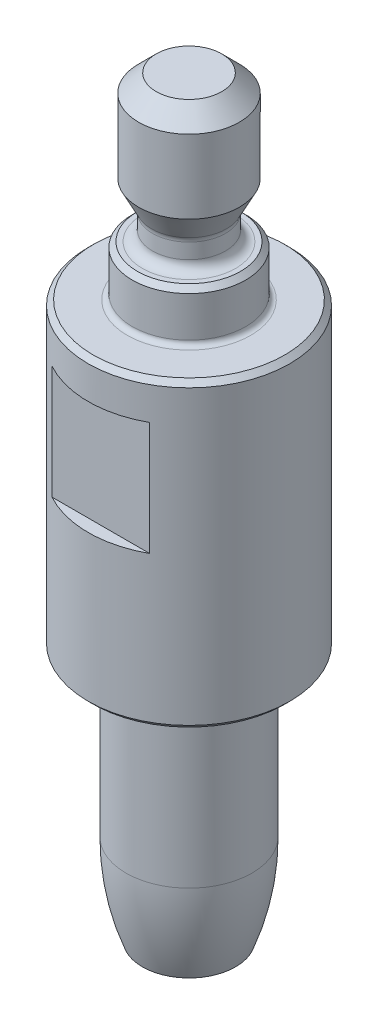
ISO-10303-21;
HEADER;
FILE_DESCRIPTION(('STEP AP214'),'2;1');
FILE_NAME('part.step','',(''),(''),'','','');
FILE_SCHEMA(('AUTOMOTIVE_DESIGN { 1 0 10303 214 1 1 1 1 }'));
ENDSEC;
DATA;
#1=APPLICATION_CONTEXT('core data for automotive mechanical design processes');
#2=APPLICATION_PROTOCOL_DEFINITION('international standard','automotive_design',2000,#1);
#3=PRODUCT_CONTEXT('',#1,'mechanical');
#4=PRODUCT('Part','Part','',(#3));
#5=PRODUCT_RELATED_PRODUCT_CATEGORY('part','',(#4));
#6=PRODUCT_DEFINITION_FORMATION('','',#4);
#7=PRODUCT_DEFINITION_CONTEXT('part definition',#1,'design');
#8=PRODUCT_DEFINITION('design','',#6,#7);
#9=PRODUCT_DEFINITION_SHAPE('','',#8);
#10=(LENGTH_UNIT() NAMED_UNIT(*) SI_UNIT(.MILLI.,.METRE.));
#11=(NAMED_UNIT(*) PLANE_ANGLE_UNIT() SI_UNIT($,.RADIAN.));
#12=(NAMED_UNIT(*) SI_UNIT($,.STERADIAN.) SOLID_ANGLE_UNIT());
#13=UNCERTAINTY_MEASURE_WITH_UNIT(LENGTH_MEASURE(1.E-05),#10,'distance_accuracy_value','');
#14=(GEOMETRIC_REPRESENTATION_CONTEXT(3) GLOBAL_UNCERTAINTY_ASSIGNED_CONTEXT((#13)) GLOBAL_UNIT_ASSIGNED_CONTEXT((#10,
#11,#12)) REPRESENTATION_CONTEXT('',''));
#15=CARTESIAN_POINT('',(0.,0.,0.));
#16=DIRECTION('',(0.,0.,1.));
#17=DIRECTION('',(1.,0.,0.));
#18=AXIS2_PLACEMENT_3D('',#15,#16,#17);
#19=CARTESIAN_POINT('',(0.,0.,0.));
#20=DIRECTION('',(0.,1.,0.));
#21=DIRECTION('',(-1.,0.,0.));
#22=AXIS2_PLACEMENT_3D('',#19,#20,#21);
#23=CYLINDRICAL_SURFACE('',#22,2.5);
#24=CARTESIAN_POINT('',(0.,-12.2,0.));
#25=DIRECTION('',(0.,-1.,0.));
#26=DIRECTION('',(0.,0.,-1.));
#27=AXIS2_PLACEMENT_3D('',#24,#25,#26);
#28=CIRCLE('',#27,2.5);
#29=CARTESIAN_POINT('',(0.,-12.2,-2.5));
#30=VERTEX_POINT('',#29);
#31=EDGE_CURVE('E64',#30,#30,#28,.T.);
#32=ORIENTED_EDGE('',*,*,#31,.T.);
#33=EDGE_LOOP('',(#32));
#34=FACE_BOUND('',#33,.T.);
#35=CARTESIAN_POINT('',(0.,-18.4535228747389,0.));
#36=DIRECTION('',(0.,1.,0.));
#37=DIRECTION('',(0.,0.,1.));
#38=AXIS2_PLACEMENT_3D('',#35,#36,#37);
#39=CIRCLE('',#38,2.5);
#40=CARTESIAN_POINT('',(0.,-18.4535228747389,2.5));
#41=VERTEX_POINT('',#40);
#42=EDGE_CURVE('E295',#41,#41,#39,.T.);
#43=ORIENTED_EDGE('',*,*,#42,.T.);
#44=EDGE_LOOP('',(#43));
#45=FACE_BOUND('',#44,.T.);
#46=ADVANCED_FACE('F15',(#34,#45),#23,.T.);
#47=CARTESIAN_POINT('',(0.,0.,0.));
#48=DIRECTION('',(0.,1.,0.));
#49=DIRECTION('',(0.,0.,1.));
#50=AXIS2_PLACEMENT_3D('',#47,#48,#49);
#51=PLANE('',#50);
#52=CARTESIAN_POINT('',(0.,0.,0.));
#53=DIRECTION('',(0.,1.,0.));
#54=DIRECTION('',(0.,0.,1.));
#55=AXIS2_PLACEMENT_3D('',#52,#53,#54);
#56=CIRCLE('',#55,2.45);
#57=CARTESIAN_POINT('',(0.,0.,2.45));
#58=VERTEX_POINT('',#57);
#59=EDGE_CURVE('E122',#58,#58,#56,.F.);
#60=ORIENTED_EDGE('',*,*,#59,.T.);
#61=EDGE_LOOP('',(#60));
#62=FACE_BOUND('',#61,.T.);
#63=CARTESIAN_POINT('',(0.,0.,0.));
#64=DIRECTION('',(0.,1.,0.));
#65=DIRECTION('',(0.,0.,1.));
#66=AXIS2_PLACEMENT_3D('',#63,#64,#65);
#67=CIRCLE('',#66,3.8);
#68=CARTESIAN_POINT('',(0.,0.,3.8));
#69=VERTEX_POINT('',#68);
#70=EDGE_CURVE('E107',#69,#69,#67,.T.);
#71=ORIENTED_EDGE('',*,*,#70,.T.);
#72=EDGE_LOOP('',(#71));
#73=FACE_BOUND('',#72,.T.);
#74=ADVANCED_FACE('F147',(#62,#73),#51,.T.);
#75=CARTESIAN_POINT('',(0.,0.,0.));
#76=DIRECTION('',(0.,-1.,0.));
#77=DIRECTION('',(0.,0.,-1.));
#78=AXIS2_PLACEMENT_3D('',#75,#76,#77);
#79=CYLINDRICAL_SURFACE('',#78,4.);
#80=DIRECTION('',(0.,-1.,0.));
#81=VECTOR('',#80,1.);
#82=CARTESIAN_POINT('',(-1.93649167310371,0.,3.5));
#83=LINE('',#82,#81);
#84=CARTESIAN_POINT('',(-1.93649167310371,-1.5,3.5));
#85=VERTEX_POINT('',#84);
#86=CARTESIAN_POINT('',(-1.93649167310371,-6.,3.5));
#87=VERTEX_POINT('',#86);
#88=EDGE_CURVE('E137',#85,#87,#83,.T.);
#89=ORIENTED_EDGE('',*,*,#88,.F.);
#90=CARTESIAN_POINT('',(0.,-1.5,0.));
#91=DIRECTION('',(0.,1.,0.));
#92=DIRECTION('',(0.,0.,1.));
#93=AXIS2_PLACEMENT_3D('',#90,#91,#92);
#94=CIRCLE('',#93,4.);
#95=CARTESIAN_POINT('',(1.93649167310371,-1.5,3.5));
#96=VERTEX_POINT('',#95);
#97=EDGE_CURVE('E9',#96,#85,#94,.F.);
#98=ORIENTED_EDGE('',*,*,#97,.F.);
#99=DIRECTION('',(0.,-1.,0.));
#100=VECTOR('',#99,1.);
#101=CARTESIAN_POINT('',(1.93649167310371,0.,3.5));
#102=LINE('',#101,#100);
#103=CARTESIAN_POINT('',(1.93649167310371,-6.,3.5));
#104=VERTEX_POINT('',#103);
#105=EDGE_CURVE('E23',#104,#96,#102,.F.);
#106=ORIENTED_EDGE('',*,*,#105,.F.);
#107=CARTESIAN_POINT('',(0.,-6.,0.));
#108=DIRECTION('',(0.,-1.,0.));
#109=DIRECTION('',(0.,0.,-1.));
#110=AXIS2_PLACEMENT_3D('',#107,#108,#109);
#111=CIRCLE('',#110,4.);
#112=EDGE_CURVE('E135',#87,#104,#111,.F.);
#113=ORIENTED_EDGE('',*,*,#112,.F.);
#114=EDGE_LOOP('',(#89,#98,#106,#113));
#115=FACE_BOUND('',#114,.T.);
#116=DIRECTION('',(0.,-1.,0.));
#117=VECTOR('',#116,1.);
#118=CARTESIAN_POINT('',(-1.93649167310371,0.,-3.5));
#119=LINE('',#118,#117);
#120=CARTESIAN_POINT('',(-1.93649167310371,-6.,-3.5));
#121=VERTEX_POINT('',#120);
#122=CARTESIAN_POINT('',(-1.93649167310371,-1.5,-3.5));
#123=VERTEX_POINT('',#122);
#124=EDGE_CURVE('E59',#121,#123,#119,.F.);
#125=ORIENTED_EDGE('',*,*,#124,.F.);
#126=CARTESIAN_POINT('',(0.,-6.,0.));
#127=DIRECTION('',(0.,-1.,0.));
#128=DIRECTION('',(0.,0.,-1.));
#129=AXIS2_PLACEMENT_3D('',#126,#127,#128);
#130=CIRCLE('',#129,4.);
#131=CARTESIAN_POINT('',(1.93649167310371,-6.,-3.5));
#132=VERTEX_POINT('',#131);
#133=EDGE_CURVE('E72',#132,#121,#130,.F.);
#134=ORIENTED_EDGE('',*,*,#133,.F.);
#135=DIRECTION('',(0.,-1.,0.));
#136=VECTOR('',#135,1.);
#137=CARTESIAN_POINT('',(1.93649167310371,0.,-3.5));
#138=LINE('',#137,#136);
#139=CARTESIAN_POINT('',(1.93649167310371,-1.5,-3.5));
#140=VERTEX_POINT('',#139);
#141=EDGE_CURVE('E60',#140,#132,#138,.T.);
#142=ORIENTED_EDGE('',*,*,#141,.F.);
#143=CARTESIAN_POINT('',(0.,-1.5,0.));
#144=DIRECTION('',(0.,1.,0.));
#145=DIRECTION('',(0.,0.,1.));
#146=AXIS2_PLACEMENT_3D('',#143,#144,#145);
#147=CIRCLE('',#146,4.);
#148=EDGE_CURVE('E54',#123,#140,#147,.F.);
#149=ORIENTED_EDGE('',*,*,#148,.F.);
#150=EDGE_LOOP('',(#125,#134,#142,#149));
#151=FACE_BOUND('',#150,.T.);
#152=CARTESIAN_POINT('',(0.,-11.8,0.));
#153=DIRECTION('',(0.,-1.,0.));
#154=DIRECTION('',(0.,0.,-1.));
#155=AXIS2_PLACEMENT_3D('',#152,#153,#154);
#156=CIRCLE('',#155,4.);
#157=CARTESIAN_POINT('',(0.,-11.8,-4.));
#158=VERTEX_POINT('',#157);
#159=EDGE_CURVE('E119',#158,#158,#156,.F.);
#160=ORIENTED_EDGE('',*,*,#159,.T.);
#161=EDGE_LOOP('',(#160));
#162=FACE_BOUND('',#161,.T.);
#163=CARTESIAN_POINT('',(0.,-0.2,0.));
#164=DIRECTION('',(0.,1.,0.));
#165=DIRECTION('',(0.,0.,1.));
#166=AXIS2_PLACEMENT_3D('',#163,#164,#165);
#167=CIRCLE('',#166,4.);
#168=CARTESIAN_POINT('',(0.,-0.2,4.));
#169=VERTEX_POINT('',#168);
#170=EDGE_CURVE('E104',#169,#169,#167,.F.);
#171=ORIENTED_EDGE('',*,*,#170,.T.);
#172=EDGE_LOOP('',(#171));
#173=FACE_BOUND('',#172,.T.);
#174=ADVANCED_FACE('F56',(#115,#151,#162,#173),#79,.T.);
#175=CARTESIAN_POINT('',(4.,-12.,0.));
#176=DIRECTION('',(0.,-1.,0.));
#177=DIRECTION('',(0.,0.,-1.));
#178=AXIS2_PLACEMENT_3D('',#175,#176,#177);
#179=PLANE('',#178);
#180=CARTESIAN_POINT('',(0.,-12.,0.));
#181=DIRECTION('',(0.,-1.,0.));
#182=DIRECTION('',(0.,0.,-1.));
#183=AXIS2_PLACEMENT_3D('',#180,#181,#182);
#184=CIRCLE('',#183,2.7);
#185=CARTESIAN_POINT('',(0.,-12.,-2.7));
#186=VERTEX_POINT('',#185);
#187=EDGE_CURVE('E128',#186,#186,#184,.F.);
#188=ORIENTED_EDGE('',*,*,#187,.T.);
#189=EDGE_LOOP('',(#188));
#190=FACE_BOUND('',#189,.T.);
#191=CARTESIAN_POINT('',(0.,-12.,0.));
#192=DIRECTION('',(0.,-1.,0.));
#193=DIRECTION('',(0.,0.,-1.));
#194=AXIS2_PLACEMENT_3D('',#191,#192,#193);
#195=CIRCLE('',#194,3.8);
#196=CARTESIAN_POINT('',(0.,-12.,-3.8));
#197=VERTEX_POINT('',#196);
#198=EDGE_CURVE('E116',#197,#197,#195,.T.);
#199=ORIENTED_EDGE('',*,*,#198,.T.);
#200=EDGE_LOOP('',(#199));
#201=FACE_BOUND('',#200,.T.);
#202=ADVANCED_FACE('F146',(#190,#201),#179,.T.);
#203=CARTESIAN_POINT('',(0.,2.,0.));
#204=DIRECTION('',(0.,1.,0.));
#205=DIRECTION('',(0.,0.,1.));
#206=AXIS2_PLACEMENT_3D('',#203,#204,#205);
#207=PLANE('',#206);
#208=CARTESIAN_POINT('',(0.,2.,0.));
#209=DIRECTION('',(0.,1.,0.));
#210=DIRECTION('',(0.,0.,1.));
#211=AXIS2_PLACEMENT_3D('',#208,#209,#210);
#212=CIRCLE('',#211,2.05);
#213=CARTESIAN_POINT('',(0.,2.,2.05));
#214=VERTEX_POINT('',#213);
#215=EDGE_CURVE('E113',#214,#214,#212,.T.);
#216=ORIENTED_EDGE('',*,*,#215,.T.);
#217=EDGE_LOOP('',(#216));
#218=FACE_BOUND('',#217,.T.);
#219=CARTESIAN_POINT('',(0.,2.,0.));
#220=DIRECTION('',(0.,1.,0.));
#221=DIRECTION('',(0.,0.,1.));
#222=AXIS2_PLACEMENT_3D('',#219,#220,#221);
#223=CIRCLE('',#222,1.85);
#224=CARTESIAN_POINT('',(0.,2.,1.85));
#225=VERTEX_POINT('',#224);
#226=EDGE_CURVE('E101',#225,#225,#223,.F.);
#227=ORIENTED_EDGE('',*,*,#226,.T.);
#228=EDGE_LOOP('',(#227));
#229=FACE_BOUND('',#228,.T.);
#230=ADVANCED_FACE('F155',(#218,#229),#207,.T.);
#231=CARTESIAN_POINT('',(0.,0.,0.));
#232=DIRECTION('',(0.,-1.,0.));
#233=DIRECTION('',(0.,0.,-1.));
#234=AXIS2_PLACEMENT_3D('',#231,#232,#233);
#235=CYLINDRICAL_SURFACE('',#234,2.25);
#236=CARTESIAN_POINT('',(0.,0.2,0.));
#237=DIRECTION('',(0.,1.,0.));
#238=DIRECTION('',(0.,0.,1.));
#239=AXIS2_PLACEMENT_3D('',#236,#237,#238);
#240=CIRCLE('',#239,2.25);
#241=CARTESIAN_POINT('',(0.,0.2,2.25));
#242=VERTEX_POINT('',#241);
#243=EDGE_CURVE('E125',#242,#242,#240,.T.);
#244=ORIENTED_EDGE('',*,*,#243,.T.);
#245=EDGE_LOOP('',(#244));
#246=FACE_BOUND('',#245,.T.);
#247=CARTESIAN_POINT('',(0.,1.8,0.));
#248=DIRECTION('',(0.,1.,0.));
#249=DIRECTION('',(0.,0.,1.));
#250=AXIS2_PLACEMENT_3D('',#247,#248,#249);
#251=CIRCLE('',#250,2.25);
#252=CARTESIAN_POINT('',(0.,1.8,2.25));
#253=VERTEX_POINT('',#252);
#254=EDGE_CURVE('E110',#253,#253,#251,.F.);
#255=ORIENTED_EDGE('',*,*,#254,.T.);
#256=EDGE_LOOP('',(#255));
#257=FACE_BOUND('',#256,.T.);
#258=ADVANCED_FACE('F179',(#246,#257),#235,.T.);
#259=CARTESIAN_POINT('',(0.,4.17943577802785,0.));
#260=DIRECTION('',(0.,1.,0.));
#261=DIRECTION('',(0.,0.,1.));
#262=AXIS2_PLACEMENT_3D('',#259,#260,#261);
#263=CONICAL_SURFACE('',#262,2.,0.471238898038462);
#264=CARTESIAN_POINT('',(0.,3.18556469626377,0.));
#265=DIRECTION('',(0.,1.,0.));
#266=DIRECTION('',(0.,0.,1.));
#267=AXIS2_PLACEMENT_3D('',#264,#265,#266);
#268=CIRCLE('',#267,1.49359739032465);
#269=CARTESIAN_POINT('',(0.,3.18556469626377,1.49359739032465));
#270=VERTEX_POINT('',#269);
#271=EDGE_CURVE('E98',#270,#270,#268,.T.);
#272=ORIENTED_EDGE('',*,*,#271,.T.);
#273=EDGE_LOOP('',(#272));
#274=FACE_BOUND('',#273,.T.);
#275=CARTESIAN_POINT('',(0.,4.17943577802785,0.));
#276=DIRECTION('',(0.,-1.,0.));
#277=DIRECTION('',(0.,0.,-1.));
#278=AXIS2_PLACEMENT_3D('',#275,#276,#277);
#279=CIRCLE('',#278,2.);
#280=CARTESIAN_POINT('',(0.,4.17943577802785,-2.));
#281=VERTEX_POINT('',#280);
#282=EDGE_CURVE('E83',#281,#281,#279,.T.);
#283=ORIENTED_EDGE('',*,*,#282,.T.);
#284=EDGE_LOOP('',(#283));
#285=FACE_BOUND('',#284,.T.);
#286=ADVANCED_FACE('F175',(#274,#285),#263,.T.);
#287=CARTESIAN_POINT('',(0.,0.,0.));
#288=DIRECTION('',(0.,-1.,0.));
#289=DIRECTION('',(0.,0.,-1.));
#290=AXIS2_PLACEMENT_3D('',#287,#288,#289);
#291=CYLINDRICAL_SURFACE('',#290,1.45);
#292=CARTESIAN_POINT('',(0.,3.00396849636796,0.));
#293=DIRECTION('',(0.,-1.,0.));
#294=DIRECTION('',(0.,0.,-1.));
#295=AXIS2_PLACEMENT_3D('',#292,#293,#294);
#296=CIRCLE('',#295,1.45);
#297=CARTESIAN_POINT('',(0.,3.00396849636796,-1.45));
#298=VERTEX_POINT('',#297);
#299=EDGE_CURVE('E95',#298,#298,#296,.T.);
#300=ORIENTED_EDGE('',*,*,#299,.T.);
#301=EDGE_LOOP('',(#300));
#302=FACE_BOUND('',#301,.T.);
#303=CARTESIAN_POINT('',(0.,2.4,0.));
#304=DIRECTION('',(0.,1.,0.));
#305=DIRECTION('',(0.,0.,1.));
#306=AXIS2_PLACEMENT_3D('',#303,#304,#305);
#307=CIRCLE('',#306,1.45);
#308=CARTESIAN_POINT('',(0.,2.4,1.45));
#309=VERTEX_POINT('',#308);
#310=EDGE_CURVE('E92',#309,#309,#307,.T.);
#311=ORIENTED_EDGE('',*,*,#310,.T.);
#312=EDGE_LOOP('',(#311));
#313=FACE_BOUND('',#312,.T.);
#314=ADVANCED_FACE('F171',(#302,#313),#291,.T.);
#315=CARTESIAN_POINT('',(0.,7.8,0.));
#316=DIRECTION('',(0.,1.,0.));
#317=DIRECTION('',(0.,0.,1.));
#318=AXIS2_PLACEMENT_3D('',#315,#316,#317);
#319=PLANE('',#318);
#320=CARTESIAN_POINT('',(0.,7.8,0.));
#321=DIRECTION('',(0.,1.,0.));
#322=DIRECTION('',(0.,0.,1.));
#323=AXIS2_PLACEMENT_3D('',#320,#321,#322);
#324=CIRCLE('',#323,1.3);
#325=CARTESIAN_POINT('',(0.,7.8,1.3));
#326=VERTEX_POINT('',#325);
#327=EDGE_CURVE('E89',#326,#326,#324,.T.);
#328=ORIENTED_EDGE('',*,*,#327,.T.);
#329=EDGE_LOOP('',(#328));
#330=FACE_BOUND('',#329,.T.);
#331=ADVANCED_FACE('F174',(#330),#319,.T.);
#332=CARTESIAN_POINT('',(0.,7.1,0.));
#333=DIRECTION('',(0.,-1.,0.));
#334=DIRECTION('',(0.,0.,-1.));
#335=AXIS2_PLACEMENT_3D('',#332,#333,#334);
#336=CONICAL_SURFACE('',#335,2.,0.78539816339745);
#337=ORIENTED_EDGE('',*,*,#327,.F.);
#338=EDGE_LOOP('',(#337));
#339=FACE_BOUND('',#338,.T.);
#340=CARTESIAN_POINT('',(0.,7.1,0.));
#341=DIRECTION('',(0.,1.,0.));
#342=DIRECTION('',(0.,0.,1.));
#343=AXIS2_PLACEMENT_3D('',#340,#341,#342);
#344=CIRCLE('',#343,2.);
#345=CARTESIAN_POINT('',(0.,7.1,2.));
#346=VERTEX_POINT('',#345);
#347=EDGE_CURVE('E86',#346,#346,#344,.F.);
#348=ORIENTED_EDGE('',*,*,#347,.F.);
#349=EDGE_LOOP('',(#348));
#350=FACE_BOUND('',#349,.T.);
#351=ADVANCED_FACE('F185',(#339,#350),#336,.T.);
#352=CARTESIAN_POINT('',(0.,2.,0.));
#353=DIRECTION('',(0.,-1.,0.));
#354=DIRECTION('',(0.,0.,-1.));
#355=AXIS2_PLACEMENT_3D('',#352,#353,#354);
#356=CYLINDRICAL_SURFACE('',#355,2.);
#357=ORIENTED_EDGE('',*,*,#282,.F.);
#358=EDGE_LOOP('',(#357));
#359=FACE_BOUND('',#358,.T.);
#360=ORIENTED_EDGE('',*,*,#347,.T.);
#361=EDGE_LOOP('',(#360));
#362=FACE_BOUND('',#361,.T.);
#363=ADVANCED_FACE('F181',(#359,#362),#356,.T.);
#364=CARTESIAN_POINT('',(0.,3.00396849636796,0.));
#365=DIRECTION('',(0.,-1.,0.));
#366=DIRECTION('',(0.,0.,-1.));
#367=AXIS2_PLACEMENT_3D('',#364,#365,#366);
#368=TOROIDAL_SURFACE('',#367,1.85,0.4);
#369=ORIENTED_EDGE('',*,*,#271,.F.);
#370=EDGE_LOOP('',(#369));
#371=FACE_BOUND('',#370,.T.);
#372=ORIENTED_EDGE('',*,*,#299,.F.);
#373=EDGE_LOOP('',(#372));
#374=FACE_BOUND('',#373,.T.);
#375=ADVANCED_FACE('F184',(#371,#374),#368,.F.);
#376=CARTESIAN_POINT('',(0.,2.4,0.));
#377=DIRECTION('',(0.,1.,0.));
#378=DIRECTION('',(0.,0.,1.));
#379=AXIS2_PLACEMENT_3D('',#376,#377,#378);
#380=TOROIDAL_SURFACE('',#379,1.85,0.4);
#381=ORIENTED_EDGE('',*,*,#310,.F.);
#382=EDGE_LOOP('',(#381));
#383=FACE_BOUND('',#382,.T.);
#384=ORIENTED_EDGE('',*,*,#226,.F.);
#385=EDGE_LOOP('',(#384));
#386=FACE_BOUND('',#385,.T.);
#387=ADVANCED_FACE('F202',(#383,#386),#380,.F.);
#388=CARTESIAN_POINT('',(0.,-0.2,0.));
#389=DIRECTION('',(0.,-1.,0.));
#390=DIRECTION('',(0.,0.,-1.));
#391=AXIS2_PLACEMENT_3D('',#388,#389,#390);
#392=CONICAL_SURFACE('',#391,4.,0.785398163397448);
#393=ORIENTED_EDGE('',*,*,#70,.F.);
#394=EDGE_LOOP('',(#393));
#395=FACE_BOUND('',#394,.T.);
#396=ORIENTED_EDGE('',*,*,#170,.F.);
#397=EDGE_LOOP('',(#396));
#398=FACE_BOUND('',#397,.T.);
#399=ADVANCED_FACE('F204',(#395,#398),#392,.T.);
#400=CARTESIAN_POINT('',(0.,1.8,0.));
#401=DIRECTION('',(0.,-1.,0.));
#402=DIRECTION('',(0.,0.,-1.));
#403=AXIS2_PLACEMENT_3D('',#400,#401,#402);
#404=CONICAL_SURFACE('',#403,2.25,0.785398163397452);
#405=ORIENTED_EDGE('',*,*,#215,.F.);
#406=EDGE_LOOP('',(#405));
#407=FACE_BOUND('',#406,.T.);
#408=ORIENTED_EDGE('',*,*,#254,.F.);
#409=EDGE_LOOP('',(#408));
#410=FACE_BOUND('',#409,.T.);
#411=ADVANCED_FACE('F212',(#407,#410),#404,.T.);
#412=CARTESIAN_POINT('',(0.,-12.,0.));
#413=DIRECTION('',(0.,1.,0.));
#414=DIRECTION('',(0.,0.,1.));
#415=AXIS2_PLACEMENT_3D('',#412,#413,#414);
#416=CONICAL_SURFACE('',#415,3.8,0.78539816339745);
#417=ORIENTED_EDGE('',*,*,#159,.F.);
#418=EDGE_LOOP('',(#417));
#419=FACE_BOUND('',#418,.T.);
#420=ORIENTED_EDGE('',*,*,#198,.F.);
#421=EDGE_LOOP('',(#420));
#422=FACE_BOUND('',#421,.T.);
#423=ADVANCED_FACE('F230',(#419,#422),#416,.T.);
#424=CARTESIAN_POINT('',(0.,0.2,0.));
#425=DIRECTION('',(0.,1.,0.));
#426=DIRECTION('',(0.,0.,1.));
#427=AXIS2_PLACEMENT_3D('',#424,#425,#426);
#428=TOROIDAL_SURFACE('',#427,2.45,0.2);
#429=ORIENTED_EDGE('',*,*,#243,.F.);
#430=EDGE_LOOP('',(#429));
#431=FACE_BOUND('',#430,.T.);
#432=ORIENTED_EDGE('',*,*,#59,.F.);
#433=EDGE_LOOP('',(#432));
#434=FACE_BOUND('',#433,.T.);
#435=ADVANCED_FACE('F235',(#431,#434),#428,.F.);
#436=CARTESIAN_POINT('',(0.,-12.2,0.));
#437=DIRECTION('',(0.,-1.,0.));
#438=DIRECTION('',(0.,0.,-1.));
#439=AXIS2_PLACEMENT_3D('',#436,#437,#438);
#440=TOROIDAL_SURFACE('',#439,2.7,0.2);
#441=ORIENTED_EDGE('',*,*,#31,.F.);
#442=EDGE_LOOP('',(#441));
#443=FACE_BOUND('',#442,.T.);
#444=ORIENTED_EDGE('',*,*,#187,.F.);
#445=EDGE_LOOP('',(#444));
#446=FACE_BOUND('',#445,.T.);
#447=ADVANCED_FACE('F17',(#443,#446),#440,.F.);
#448=CARTESIAN_POINT('',(-4.,-6.,-4.));
#449=DIRECTION('',(0.,-1.,0.));
#450=DIRECTION('',(0.,0.,-1.));
#451=AXIS2_PLACEMENT_3D('',#448,#449,#450);
#452=PLANE('',#451);
#453=ORIENTED_EDGE('',*,*,#133,.T.);
#454=DIRECTION('',(1.,0.,0.));
#455=VECTOR('',#454,1.);
#456=CARTESIAN_POINT('',(-4.,-6.,-3.5));
#457=LINE('',#456,#455);
#458=EDGE_CURVE('E71',#121,#132,#457,.T.);
#459=ORIENTED_EDGE('',*,*,#458,.T.);
#460=EDGE_LOOP('',(#453,#459));
#461=FACE_BOUND('',#460,.T.);
#462=ADVANCED_FACE('F243',(#461),#452,.F.);
#463=CARTESIAN_POINT('',(-4.,-1.5,-3.5));
#464=DIRECTION('',(0.,0.,1.));
#465=DIRECTION('',(0.,-1.,0.));
#466=AXIS2_PLACEMENT_3D('',#463,#464,#465);
#467=PLANE('',#466);
#468=ORIENTED_EDGE('',*,*,#124,.T.);
#469=DIRECTION('',(1.,0.,0.));
#470=VECTOR('',#469,1.);
#471=CARTESIAN_POINT('',(-4.,-1.5,-3.5));
#472=LINE('',#471,#470);
#473=EDGE_CURVE('E69',#123,#140,#472,.T.);
#474=ORIENTED_EDGE('',*,*,#473,.T.);
#475=ORIENTED_EDGE('',*,*,#141,.T.);
#476=ORIENTED_EDGE('',*,*,#458,.F.);
#477=EDGE_LOOP('',(#468,#474,#475,#476));
#478=FACE_BOUND('',#477,.T.);
#479=ADVANCED_FACE('F68',(#478),#467,.F.);
#480=CARTESIAN_POINT('',(-4.,-1.5,-4.));
#481=DIRECTION('',(0.,1.,0.));
#482=DIRECTION('',(0.,0.,1.));
#483=AXIS2_PLACEMENT_3D('',#480,#481,#482);
#484=PLANE('',#483);
#485=ORIENTED_EDGE('',*,*,#473,.F.);
#486=ORIENTED_EDGE('',*,*,#148,.T.);
#487=EDGE_LOOP('',(#485,#486));
#488=FACE_BOUND('',#487,.T.);
#489=ADVANCED_FACE('F74',(#488),#484,.F.);
#490=CARTESIAN_POINT('',(-4.,-1.5,4.));
#491=DIRECTION('',(0.,1.,0.));
#492=DIRECTION('',(0.,0.,1.));
#493=AXIS2_PLACEMENT_3D('',#490,#491,#492);
#494=PLANE('',#493);
#495=ORIENTED_EDGE('',*,*,#97,.T.);
#496=DIRECTION('',(1.,0.,0.));
#497=VECTOR('',#496,1.);
#498=CARTESIAN_POINT('',(-4.,-1.5,3.5));
#499=LINE('',#498,#497);
#500=EDGE_CURVE('E77',#85,#96,#499,.T.);
#501=ORIENTED_EDGE('',*,*,#500,.T.);
#502=EDGE_LOOP('',(#495,#501));
#503=FACE_BOUND('',#502,.T.);
#504=ADVANCED_FACE('F275',(#503),#494,.F.);
#505=CARTESIAN_POINT('',(-4.,-1.5,3.5));
#506=DIRECTION('',(0.,0.,-1.));
#507=DIRECTION('',(0.,1.,0.));
#508=AXIS2_PLACEMENT_3D('',#505,#506,#507);
#509=PLANE('',#508);
#510=ORIENTED_EDGE('',*,*,#105,.T.);
#511=ORIENTED_EDGE('',*,*,#500,.F.);
#512=ORIENTED_EDGE('',*,*,#88,.T.);
#513=DIRECTION('',(1.,0.,0.));
#514=VECTOR('',#513,1.);
#515=CARTESIAN_POINT('',(-4.,-6.,3.5));
#516=LINE('',#515,#514);
#517=EDGE_CURVE('E75',#87,#104,#516,.T.);
#518=ORIENTED_EDGE('',*,*,#517,.T.);
#519=EDGE_LOOP('',(#510,#511,#512,#518));
#520=FACE_BOUND('',#519,.T.);
#521=ADVANCED_FACE('F141',(#520),#509,.F.);
#522=CARTESIAN_POINT('',(-4.,-6.,4.));
#523=DIRECTION('',(0.,-1.,0.));
#524=DIRECTION('',(0.,0.,-1.));
#525=AXIS2_PLACEMENT_3D('',#522,#523,#524);
#526=PLANE('',#525);
#527=ORIENTED_EDGE('',*,*,#517,.F.);
#528=ORIENTED_EDGE('',*,*,#112,.T.);
#529=EDGE_LOOP('',(#527,#528));
#530=FACE_BOUND('',#529,.T.);
#531=ADVANCED_FACE('F144',(#530),#526,.F.);
#532=CARTESIAN_POINT('',(0.,-18.4535228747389,0.));
#533=DIRECTION('',(0.,1.,0.));
#534=DIRECTION('',(0.,0.,1.));
#535=AXIS2_PLACEMENT_3D('',#532,#533,#534);
#536=DEGENERATE_TOROIDAL_SURFACE('',#535,7.5,10.,.F.);
#537=CARTESIAN_POINT('',(0.,-22.,0.));
#538=DIRECTION('',(0.,1.,0.));
#539=DIRECTION('',(0.,0.,1.));
#540=AXIS2_PLACEMENT_3D('',#537,#538,#539);
#541=CIRCLE('',#540,1.85);
#542=CARTESIAN_POINT('',(0.,-22.,1.85));
#543=VERTEX_POINT('',#542);
#544=EDGE_CURVE('E79',#543,#543,#541,.T.);
#545=ORIENTED_EDGE('',*,*,#544,.T.);
#546=EDGE_LOOP('',(#545));
#547=FACE_BOUND('',#546,.T.);
#548=ORIENTED_EDGE('',*,*,#42,.F.);
#549=EDGE_LOOP('',(#548));
#550=FACE_BOUND('',#549,.T.);
#551=ADVANCED_FACE('F278',(#547,#550),#536,.F.);
#552=CARTESIAN_POINT('',(2.23205080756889,-22.,0.));
#553=DIRECTION('',(0.,1.,0.));
#554=DIRECTION('',(-1.,0.,0.));
#555=AXIS2_PLACEMENT_3D('',#552,#553,#554);
#556=PLANE('',#555);
#557=ORIENTED_EDGE('',*,*,#544,.F.);
#558=EDGE_LOOP('',(#557));
#559=FACE_BOUND('',#558,.T.);
#560=ADVANCED_FACE('F169',(#559),#556,.F.);
#561=CLOSED_SHELL('',(#46,#74,#174,#202,#230,#258,#286,#314,#331,#351,#363,#375,#387,#399,#411,
#423,#435,#447,#462,#479,#489,#504,#521,#531,#551,#560));
#562=MANIFOLD_SOLID_BREP('B1',#561);
#563=ADVANCED_BREP_SHAPE_REPRESENTATION('',(#18,#562),#14);
#564=SHAPE_DEFINITION_REPRESENTATION(#9,#563);
ENDSEC;
END-ISO-10303-21;
